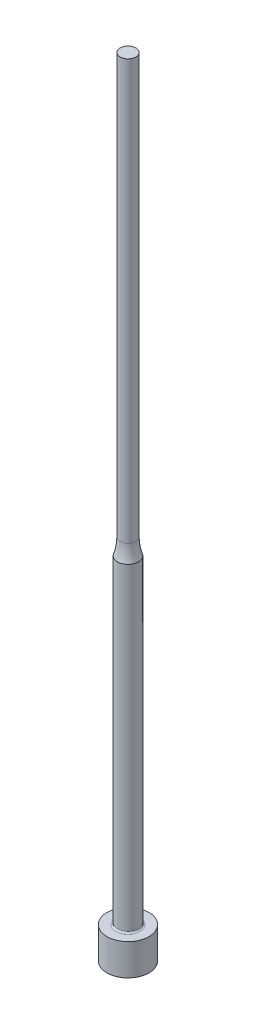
from build123d import *


with BuildPart() as part:
    # Sketch1 → Revolve1 (revolve)
    with BuildSketch(Plane.XY, mode=Mode.PRIVATE) as revolve1_sk:
        with BuildLine():
            Line((0, 0), (4, 0))
            Line((4, 0), (4, 6))
            Line((4, 6), (2.3, 6))
            ThreePointArc((2.3, 6), (2.087867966, 6.087867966), (2, 6.3))
            Line((2, 6.3), (2, 66.877501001))
            ThreePointArc((2, 66.877501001), (1.625791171, 68.41886117), (1.5, 70))
            Line((1.5, 70), (1.5, 150))
            Line((1.5, 150), (0, 150))
            Line((0, 150), (0, 0))
        make_face()
    revolve(revolve1_sk.sketch.rotate(Axis((0, 150, 0), (0, -1, 0)), 180), axis=Axis((0, 150, 0), (0, -1, 0)))


solid = part.part
